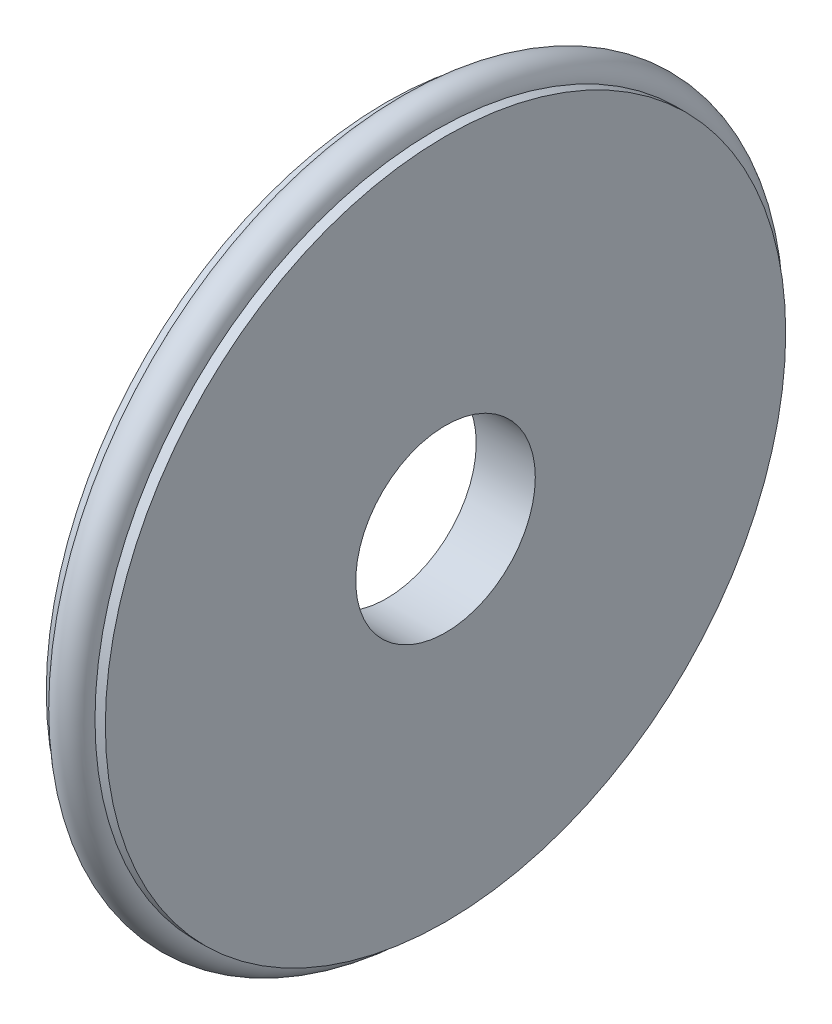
from build123d import *

# Parameters (mm, degrees)
F_19_0_19_DIAMETER_HOLE1_D = 19
SKETCH4_R                  = 2.0285874


with BuildPart() as part:
    # Sketch1 → Revolve1 (revolve)
    with BuildSketch(Plane.XY, mode=Mode.PRIVATE) as revolve1_sk:
        with BuildLine():
            Line((-3.125, 0), (3.125, 0))
            Line((3.125, 0), (3.125, 36))
            Line((3.125, 36), (2, 36))
            ThreePointArc((2, 36), (0, 34), (-2, 36))
            Line((-2, 36), (-3.125, 36))
            Line((-3.125, 36), (-3.125, 0))
        make_face()
    revolve(revolve1_sk.sketch.rotate(Axis((-22.996218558, 0, 0), (1, 0, 0)), 180), axis=Axis((-22.996218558, 0, 0), (1, 0, 0)))

    # 19.0 _19_ Diameter Hole1 (through all)
    with Locations(Plane(origin=(3.125, 0, 0), x_dir=(0, 0, -1), z_dir=(1, 0, 0))):
        with Locations((0, 0)):
            Hole(F_19_0_19_DIAMETER_HOLE1_D / 2)

    # Sketch4 → Revolve2 (revolve)
    with BuildSketch(Plane(origin=(0, 0, 0), x_dir=(1, 0, 0), z_dir=(0, 1, 0)), mode=Mode.PRIVATE) as revolve2_sk:
        with Locations((0, 36)):
            Circle(SKETCH4_R)
    revolve(revolve2_sk.sketch.rotate(Axis((-3.125, 0, 0), (1, 0, 0)), 270), axis=Axis((-3.125, 0, 0), (1, 0, 0)))


solid = part.part
